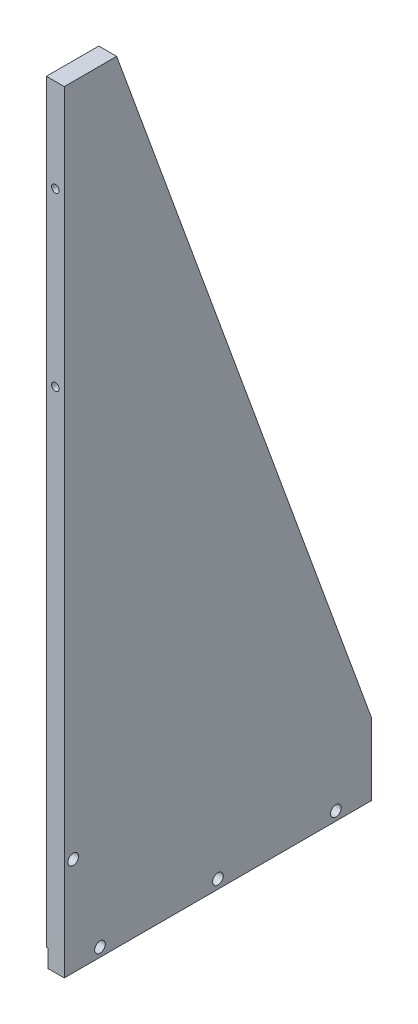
from build123d import *

# Parameters (mm, degrees)
BOSS_EXTRUDE1_DEPTH       = 6.35
F_6_32_TAPPED_HOLE1_D     = 2.7051
F_6_32_TAPPED_HOLE1_DEPTH = 10.9728
F_6_32_TAPPED_HOLE1_TIP   = 0.81269403
SKETCH4_W                 = 109.22
SKETCH4_H                 = 6.35
CUT_EXTRUDE1_DEPTH        = 0.635
F_6_CLEARANCE_HOLE1_D     = 3.7973


with BuildPart() as part:
    # Sketch1 → Boss-Extrude1 (new body)
    with BuildSketch(Plane(origin=(0, 0, 0), x_dir=(0, 0, -1), z_dir=(1, 0, 0))):
        Polygon((0, 274.32), (0, 0), (109.22, 0), (109.22, 25.4), (18.620529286, 274.32), align=None)
    extrude(amount=BOSS_EXTRUDE1_DEPTH)

    # 6-32 Tapped Hole1
    with Locations(Plane.XY):
        with Locations((3.175, 241.3), (3.175, 180.34)):
            Hole(F_6_32_TAPPED_HOLE1_D / 2, depth=F_6_32_TAPPED_HOLE1_DEPTH)
            with Locations((0, 0, -(F_6_32_TAPPED_HOLE1_DEPTH + F_6_32_TAPPED_HOLE1_TIP / 2))):  # 118° drill point
                Cone(0, F_6_32_TAPPED_HOLE1_D / 2, F_6_32_TAPPED_HOLE1_TIP, mode=Mode.SUBTRACT)

    # Sketch4 → Cut-Extrude1 (cut)
    with BuildSketch(Plane.ZY):
        with Locations((-54.61, 3.175)):
            Rectangle(SKETCH4_W, SKETCH4_H)
    extrude(amount=-CUT_EXTRUDE1_DEPTH, mode=Mode.SUBTRACT)

    # 6 Clearance Hole1 (through all)
    with Locations(Plane(origin=(6.35, 0, 0), x_dir=(0, 0, -1), z_dir=(1, 0, 0))):
        with Locations((3.175, 34.925), (12.7, 3.175), (54.61, 3.175), (96.52, 3.175)):
            Hole(F_6_CLEARANCE_HOLE1_D / 2)


solid = part.part
